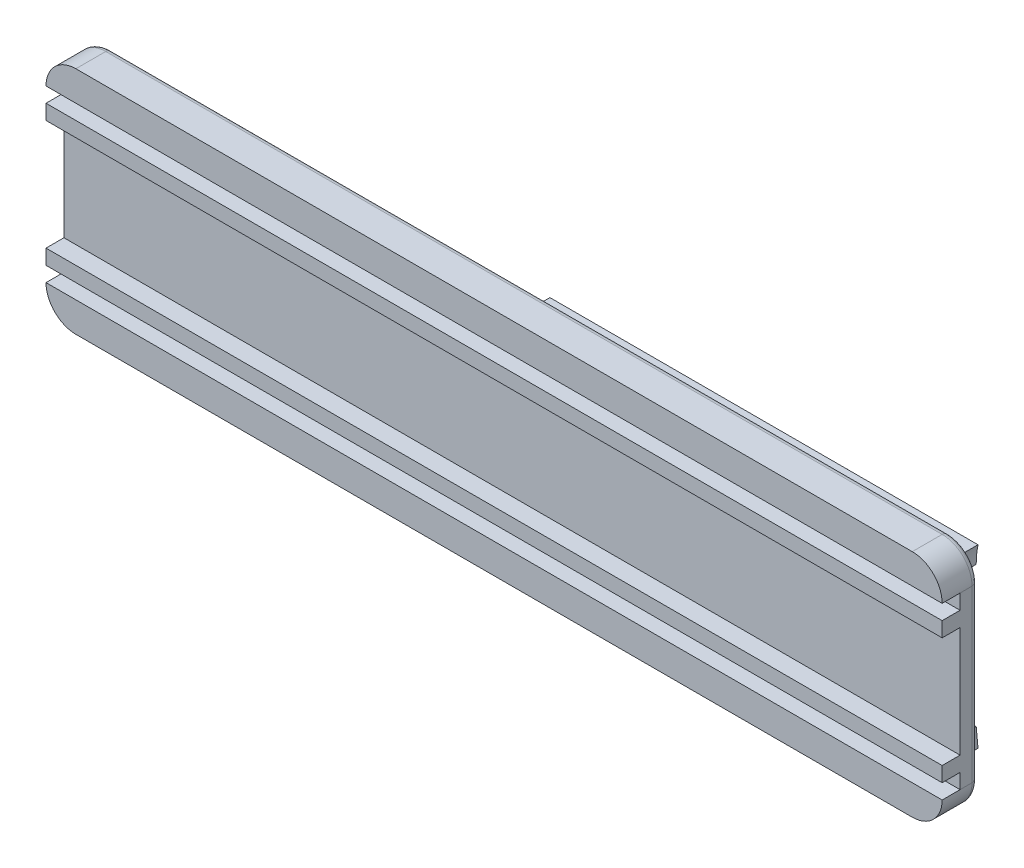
from build123d import *

# Parameters (mm, degrees)
Y_KSEKLIK_EKSTR_ZYON1_DEPTH   = 10
Y_KSEKLIK_EKSTR_ZYON1_2_DEPTH = 10
IZIM2_W                       = 300
IZIM2_H                       = 77
Y_KSEKLIK_EKSTR_ZYON2_DEPTH   = 12
RADYUS1_R                     = 10
IZIM3_W                       = 300
IZIM3_H                       = 37
KES_EKSTR_ZYON2_DEPTH         = 6
IZIM4_W                       = 300
IZIM4_H                       = 5
KES_EKSTR_ZYON3_DEPTH         = 6
RADYUS2_R                     = 2


with BuildPart() as part:
    # izim1 → Y_kseklik-Ekstr_zyon1 (new body)
    with BuildSketch(Plane.XY):
        Polygon((-92.794429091, -56), (45.396546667, -56), (46, -62), (-97.305663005, -62), (-97.305663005, -56), align=None)
    extrude(amount=Y_KSEKLIK_EKSTR_ZYON1_DEPTH)



with BuildPart() as body_2:
    # izim1 → Y_kseklik-Ekstr_zyon1 2 (new body)
    with BuildSketch(Plane.XY):
        with BuildLine():
            Line((-92.794429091, -9), (45.396546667, -9))
            ThreePointArc((45.396546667, -9), (45.547789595, -5.984865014), (46, -3))
            Line((46, -3), (-97.305663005, -3))
            Line((-97.305663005, -3), (-97.305663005, -9))
            Line((-97.305663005, -9), (-92.794429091, -9))
        make_face()
    extrude(amount=Y_KSEKLIK_EKSTR_ZYON1_2_DEPTH)


with BuildPart() as part_1:
    add(part.part)

    add(body_2.part)  # Y_kseklik-Ekstr_zyon2 merges body 2
    # izim2 → Y_kseklik-Ekstr_zyon2 (add)
    with BuildSketch(Plane.XY.offset(10)):
        with Locations((-94, -32.5)):
            Rectangle(IZIM2_W, IZIM2_H)
    extrude(amount=Y_KSEKLIK_EKSTR_ZYON2_DEPTH)

    # Radyus1
    radyus1_edges = [part_1.edges().sort_by_distance(p)[0] for p in [
        (56, -71, 16),
        (56, 6, 16),
        (-244, 6, 16),
        (-244, -71, 16),
    ]]
    fillet(radyus1_edges, radius=RADYUS1_R)

    # izim3 → Kes-Ekstr_zyon2 (cut)
    with BuildSketch(Plane.XY.offset(22)):
        with Locations((-94, -32.5)):
            Rectangle(IZIM3_W, IZIM3_H)
    extrude(amount=-KES_EKSTR_ZYON2_DEPTH, mode=Mode.SUBTRACT)

    # izim4 → Kes-Ekstr_zyon3 (cut)
    with BuildSketch(Plane.XY.offset(22)):
        with Locations((-94, -6.5)):
            Rectangle(IZIM4_W, IZIM4_H)
        with Locations((-94, -58.5)):
            Rectangle(IZIM4_W, IZIM4_H)
    extrude(amount=-KES_EKSTR_ZYON3_DEPTH, mode=Mode.SUBTRACT)

    # Radyus2
    radyus2_edges = [part_1.edges().sort_by_distance(p)[0] for p in [
        (56, -32.5, 10),
        (-94, -71, 10),
        (-244, -32.5, 10),
        (-94, 6, 10),
        (-241.071067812, -68.071067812, 10),
        (-241.071067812, 3.071067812, 10),
        (53.071067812, 3.071067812, 10),
        (53.071067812, -68.071067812, 10),
    ]]
    fillet(radyus2_edges, radius=RADYUS2_R)


solid = part_1.part
